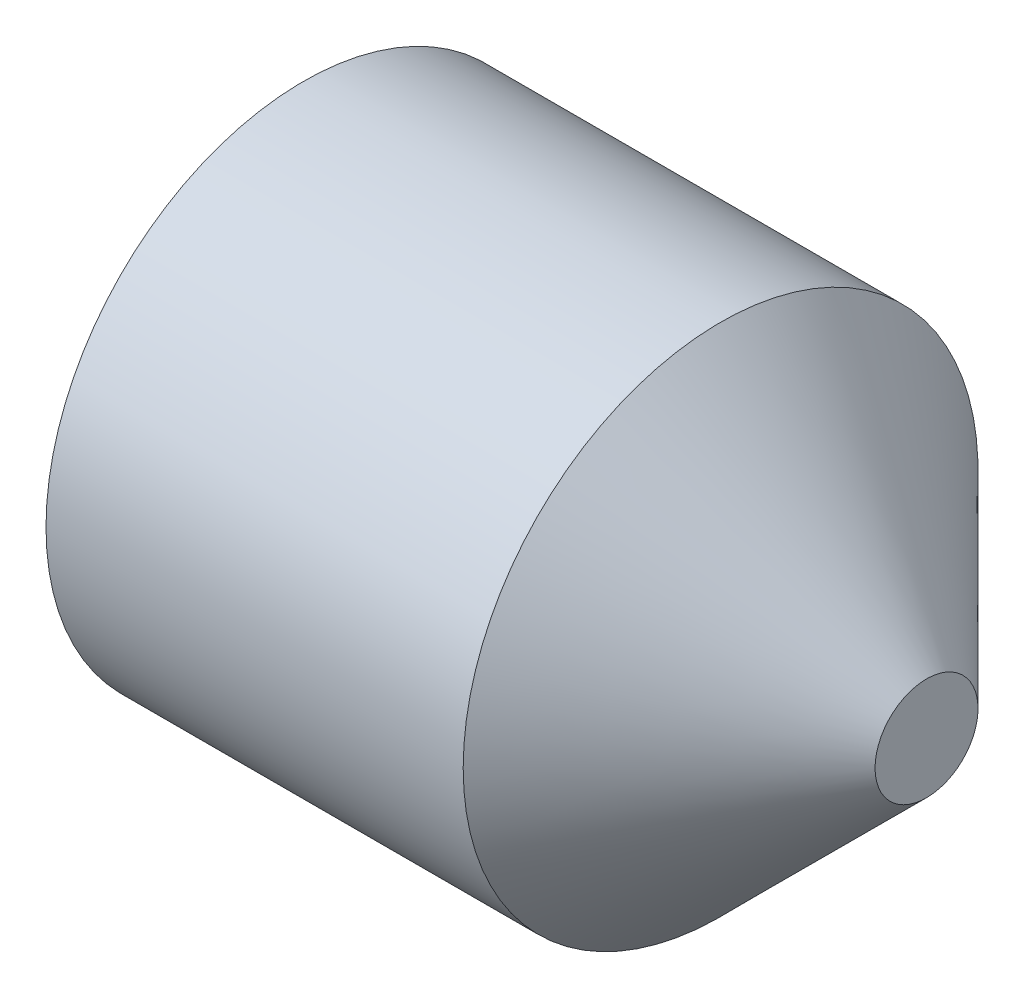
from build123d import *

# Parameters (mm, degrees)
HEX_2_DEPTH = 10


with BuildPart() as part:
    # BodySke → BaseBody (revolve)
    with BuildSketch(Plane.XY, mode=Mode.PRIVATE) as basebody_sk:
        Polygon((0, 0), (0, 10.352), (0.951473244, 12), (20.4, 12), (30, 2.4), (30, 0), align=None)
    revolve(basebody_sk.sketch.rotate(Axis((-12.7, 0, 0), (1, 0, 0)), 90), axis=Axis((-12.7, 0, 0), (1, 0, 0)))

    # Sketch2 → Hex 2 (cut)
    with BuildSketch(Plane.ZY):
        Polygon((3.464101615, 6), (-3.464101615, 6), (-6.92820323, 0), (-3.464101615, -6), (3.464101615, -6), (6.92820323, 0), align=None)
    extrude(amount=-HEX_2_DEPTH, mode=Mode.SUBTRACT)


solid = part.part
